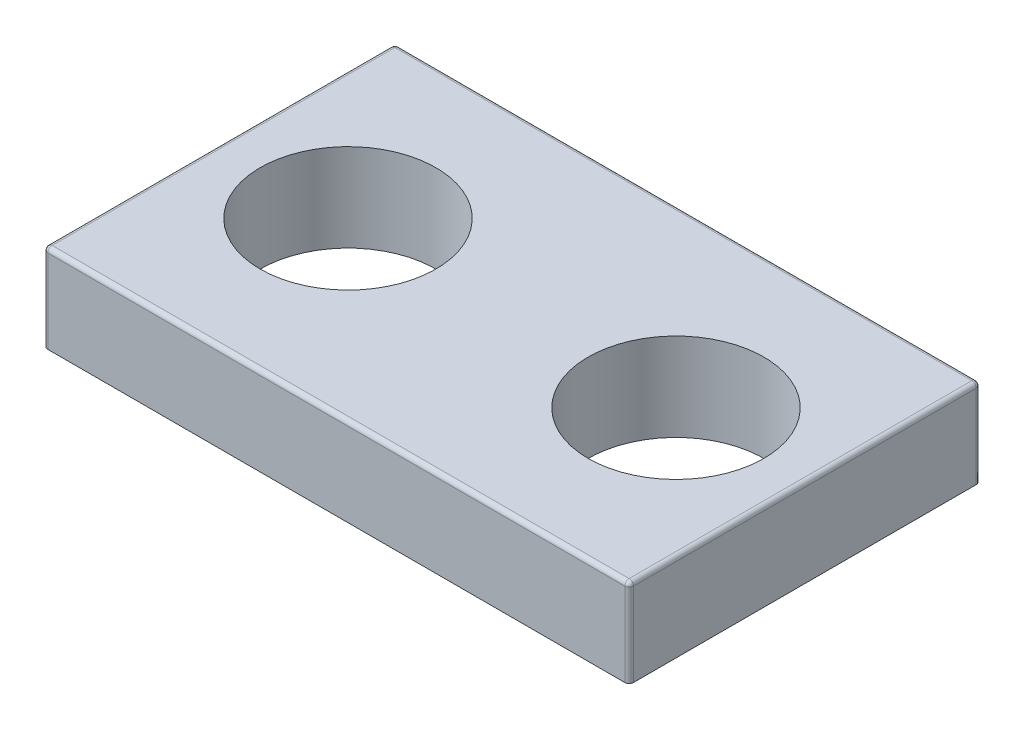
from build123d import *

# Parameters (mm, degrees)
SKETCH1_W           = 100
SKETCH1_H           = 60
SKETCH1_R           = 15
BOSS_EXTRUDE1_DEPTH = 15
FILLET1_R           = 0.75


with BuildPart() as part:
    # Sketch1 → Boss-Extrude1 (new body)
    with BuildSketch(Plane(origin=(0, 0, 0), x_dir=(1, 0, 0), z_dir=(0, 1, 0))):
        Rectangle(SKETCH1_W, SKETCH1_H)
        with Locations(Location((-28, 0, 0), (0, 0, 270))):
            Circle(SKETCH1_R, mode=Mode.SUBTRACT)
        with Locations(Location((28, 0, 0), (0, 0, 270))):
            Circle(SKETCH1_R, mode=Mode.SUBTRACT)
    extrude(amount=BOSS_EXTRUDE1_DEPTH)

    # Fillet1
    fillet1_edges = [part.edges().sort_by_distance(p)[0] for p in [
        (-50, 15, 0),
        (0, 15, 30),
        (50, 15, 0),
        (0, 15, -30),
        (50, 7.5, 30),
        (-50, 7.5, 30),
        (-50, 7.5, -30),
        (50, 7.5, -30),
    ]]
    fillet(fillet1_edges, radius=FILLET1_R)


solid = part.part
